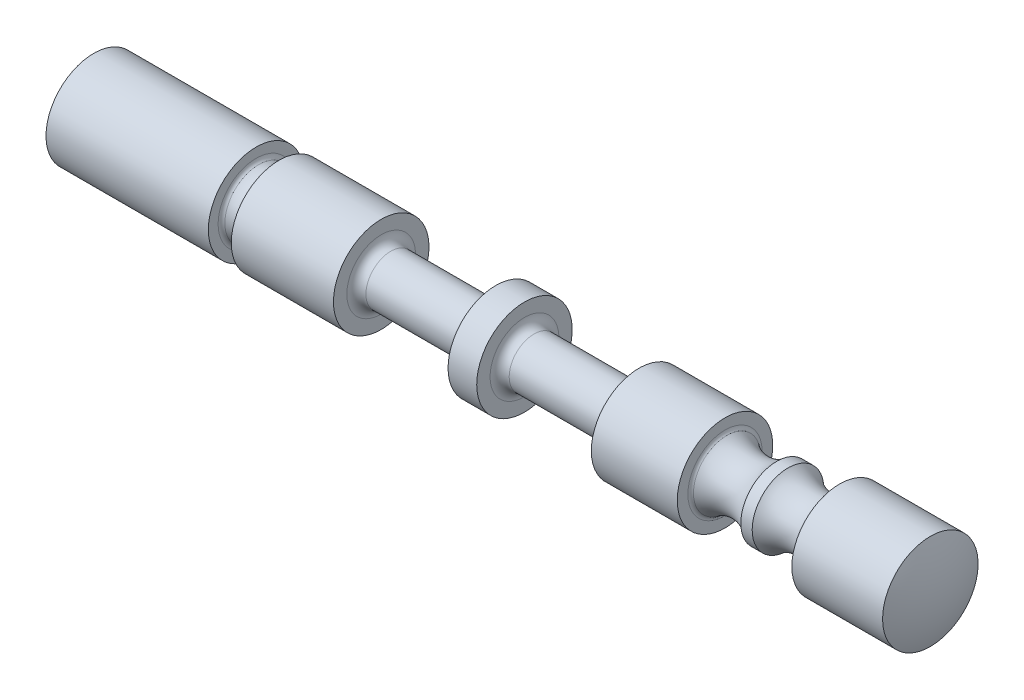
ISO-10303-21;
HEADER;
FILE_DESCRIPTION(('STEP AP214'),'2;1');
FILE_NAME('part.step','',(''),(''),'','','');
FILE_SCHEMA(('AUTOMOTIVE_DESIGN { 1 0 10303 214 1 1 1 1 }'));
ENDSEC;
DATA;
#1=APPLICATION_CONTEXT('core data for automotive mechanical design processes');
#2=APPLICATION_PROTOCOL_DEFINITION('international standard','automotive_design',2000,#1);
#3=PRODUCT_CONTEXT('',#1,'mechanical');
#4=PRODUCT('Part','Part','',(#3));
#5=PRODUCT_RELATED_PRODUCT_CATEGORY('part','',(#4));
#6=PRODUCT_DEFINITION_FORMATION('','',#4);
#7=PRODUCT_DEFINITION_CONTEXT('part definition',#1,'design');
#8=PRODUCT_DEFINITION('design','',#6,#7);
#9=PRODUCT_DEFINITION_SHAPE('','',#8);
#10=(LENGTH_UNIT() NAMED_UNIT(*) SI_UNIT(.MILLI.,.METRE.));
#11=(NAMED_UNIT(*) PLANE_ANGLE_UNIT() SI_UNIT($,.RADIAN.));
#12=(NAMED_UNIT(*) SI_UNIT($,.STERADIAN.) SOLID_ANGLE_UNIT());
#13=UNCERTAINTY_MEASURE_WITH_UNIT(LENGTH_MEASURE(1.E-05),#10,'distance_accuracy_value','');
#14=(GEOMETRIC_REPRESENTATION_CONTEXT(3) GLOBAL_UNCERTAINTY_ASSIGNED_CONTEXT((#13)) GLOBAL_UNIT_ASSIGNED_CONTEXT((#10,
#11,#12)) REPRESENTATION_CONTEXT('',''));
#15=CARTESIAN_POINT('',(0.,0.,0.));
#16=DIRECTION('',(0.,0.,1.));
#17=DIRECTION('',(1.,0.,0.));
#18=AXIS2_PLACEMENT_3D('',#15,#16,#17);
#19=CARTESIAN_POINT('',(-68.,0.,0.));
#20=DIRECTION('',(0.,0.,1.));
#21=DIRECTION('',(1.,0.,0.));
#22=AXIS2_PLACEMENT_3D('',#19,#20,#21);
#23=SPHERICAL_SURFACE('',#22,13.);
#24=CARTESIAN_POINT('',(-68.,0.,0.));
#25=DIRECTION('',(-1.,0.,0.));
#26=DIRECTION('',(0.,0.,1.));
#27=AXIS2_PLACEMENT_3D('',#24,#25,#26);
#28=SPHERICAL_SURFACE('',#27,13.);
#29=CARTESIAN_POINT('',(-80.,0.,0.));
#30=DIRECTION('',(-1.,0.,0.));
#31=DIRECTION('',(0.,0.,1.));
#32=AXIS2_PLACEMENT_3D('',#29,#30,#31);
#33=CIRCLE('',#32,5.);
#34=CARTESIAN_POINT('',(-80.,0.,5.00000000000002));
#35=VERTEX_POINT('',#34);
#36=EDGE_CURVE('E412',#35,#35,#33,.T.);
#37=ORIENTED_EDGE('',*,*,#36,.T.);
#38=EDGE_LOOP('',(#37));
#39=FACE_BOUND('',#38,.T.);
#40=ADVANCED_FACE('F356',(#39),#28,.T.);
#41=CARTESIAN_POINT('',(-110.,0.,0.));
#42=DIRECTION('',(-1.,0.,0.));
#43=DIRECTION('',(0.,0.,1.));
#44=AXIS2_PLACEMENT_3D('',#41,#42,#43);
#45=CYLINDRICAL_SURFACE('',#44,5.);
#46=ORIENTED_EDGE('',*,*,#36,.F.);
#47=EDGE_LOOP('',(#46));
#48=FACE_BOUND('',#47,.T.);
#49=CARTESIAN_POINT('',(-63.,0.,0.));
#50=DIRECTION('',(-1.,0.,0.));
#51=DIRECTION('',(0.,0.,1.));
#52=AXIS2_PLACEMENT_3D('',#49,#50,#51);
#53=CIRCLE('',#52,5.);
#54=CARTESIAN_POINT('',(-63.,0.,5.00000000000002));
#55=VERTEX_POINT('',#54);
#56=EDGE_CURVE('E415',#55,#55,#53,.T.);
#57=ORIENTED_EDGE('',*,*,#56,.T.);
#58=EDGE_LOOP('',(#57));
#59=FACE_BOUND('',#58,.T.);
#60=ADVANCED_FACE('F464',(#48,#59),#45,.T.);
#61=CARTESIAN_POINT('',(-63.,5.0000000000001,0.));
#62=DIRECTION('',(-1.,0.,0.));
#63=DIRECTION('',(0.,0.,1.));
#64=AXIS2_PLACEMENT_3D('',#61,#62,#63);
#65=PLANE('',#64);
#66=CARTESIAN_POINT('',(-63.,0.,0.));
#67=DIRECTION('',(-1.,0.,0.));
#68=DIRECTION('',(0.,0.,1.));
#69=AXIS2_PLACEMENT_3D('',#66,#67,#68);
#70=CIRCLE('',#69,3.97822521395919);
#71=CARTESIAN_POINT('',(-63.,0.,3.97822521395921));
#72=VERTEX_POINT('',#71);
#73=EDGE_CURVE('E409',#72,#72,#70,.T.);
#74=ORIENTED_EDGE('',*,*,#73,.T.);
#75=EDGE_LOOP('',(#74));
#76=FACE_BOUND('',#75,.T.);
#77=ORIENTED_EDGE('',*,*,#56,.F.);
#78=EDGE_LOOP('',(#77));
#79=FACE_BOUND('',#78,.T.);
#80=ADVANCED_FACE('F469',(#76,#79),#65,.F.);
#81=CARTESIAN_POINT('',(-61.8,0.,0.));
#82=DIRECTION('',(-1.,0.,0.));
#83=DIRECTION('',(0.,0.,1.));
#84=AXIS2_PLACEMENT_3D('',#81,#82,#83);
#85=TOROIDAL_SURFACE('',#84,5.30487513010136,2.);
#86=CARTESIAN_POINT('',(-62.7333333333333,0.,0.));
#87=DIRECTION('',(1.,0.,0.));
#88=DIRECTION('',(0.,0.,-1.));
#89=AXIS2_PLACEMENT_3D('',#86,#87,#88);
#90=CIRCLE('',#89,3.53600857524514);
#91=CARTESIAN_POINT('',(-62.7333333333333,0.,-3.53600857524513));
#92=VERTEX_POINT('',#91);
#93=EDGE_CURVE('E403',#92,#92,#90,.T.);
#94=ORIENTED_EDGE('',*,*,#93,.T.);
#95=EDGE_LOOP('',(#94));
#96=FACE_BOUND('',#95,.T.);
#97=CARTESIAN_POINT('',(-60.8666666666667,0.,0.));
#98=DIRECTION('',(-1.,0.,0.));
#99=DIRECTION('',(0.,0.,1.));
#100=AXIS2_PLACEMENT_3D('',#97,#98,#99);
#101=CIRCLE('',#100,3.53600857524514);
#102=CARTESIAN_POINT('',(-60.8666666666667,0.,3.53600857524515));
#103=VERTEX_POINT('',#102);
#104=EDGE_CURVE('E406',#103,#103,#101,.T.);
#105=ORIENTED_EDGE('',*,*,#104,.T.);
#106=EDGE_LOOP('',(#105));
#107=FACE_BOUND('',#106,.T.);
#108=ADVANCED_FACE('F475',(#96,#107),#85,.F.);
#109=CARTESIAN_POINT('',(-60.6,5.0000000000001,0.));
#110=DIRECTION('',(1.,0.,0.));
#111=DIRECTION('',(0.,0.,-1.));
#112=AXIS2_PLACEMENT_3D('',#109,#110,#111);
#113=PLANE('',#112);
#114=CARTESIAN_POINT('',(-60.6,0.,0.));
#115=DIRECTION('',(1.,0.,0.));
#116=DIRECTION('',(0.,0.,-1.));
#117=AXIS2_PLACEMENT_3D('',#114,#115,#116);
#118=CIRCLE('',#117,3.97822521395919);
#119=CARTESIAN_POINT('',(-60.6,0.,-3.97822521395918));
#120=VERTEX_POINT('',#119);
#121=EDGE_CURVE('E388',#120,#120,#118,.T.);
#122=ORIENTED_EDGE('',*,*,#121,.T.);
#123=EDGE_LOOP('',(#122));
#124=FACE_BOUND('',#123,.T.);
#125=CARTESIAN_POINT('',(-60.6,0.,0.));
#126=DIRECTION('',(-1.,0.,0.));
#127=DIRECTION('',(0.,0.,1.));
#128=AXIS2_PLACEMENT_3D('',#125,#126,#127);
#129=CIRCLE('',#128,5.);
#130=CARTESIAN_POINT('',(-60.6,0.,5.00000000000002));
#131=VERTEX_POINT('',#130);
#132=EDGE_CURVE('E418',#131,#131,#129,.T.);
#133=ORIENTED_EDGE('',*,*,#132,.T.);
#134=EDGE_LOOP('',(#133));
#135=FACE_BOUND('',#134,.T.);
#136=ADVANCED_FACE('F479',(#124,#135),#113,.F.);
#137=CARTESIAN_POINT('',(-110.,0.,0.));
#138=DIRECTION('',(-1.,0.,0.));
#139=DIRECTION('',(0.,0.,1.));
#140=AXIS2_PLACEMENT_3D('',#137,#138,#139);
#141=CYLINDRICAL_SURFACE('',#140,5.);
#142=ORIENTED_EDGE('',*,*,#132,.F.);
#143=EDGE_LOOP('',(#142));
#144=FACE_BOUND('',#143,.T.);
#145=CARTESIAN_POINT('',(-49.9,1.11022302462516E-13,0.));
#146=DIRECTION('',(-1.,0.,0.));
#147=DIRECTION('',(0.,0.,1.));
#148=AXIS2_PLACEMENT_3D('',#145,#146,#147);
#149=CIRCLE('',#148,5.);
#150=CARTESIAN_POINT('',(-49.9,1.11022302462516E-13,5.00000000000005));
#151=VERTEX_POINT('',#150);
#152=EDGE_CURVE('E421',#151,#151,#149,.T.);
#153=ORIENTED_EDGE('',*,*,#152,.T.);
#154=EDGE_LOOP('',(#153));
#155=FACE_BOUND('',#154,.T.);
#156=ADVANCED_FACE('F483',(#144,#155),#141,.T.);
#157=CARTESIAN_POINT('',(-49.9,5.00000000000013,0.));
#158=DIRECTION('',(-1.,0.,0.));
#159=DIRECTION('',(0.,0.,1.));
#160=AXIS2_PLACEMENT_3D('',#157,#158,#159);
#161=PLANE('',#160);
#162=CARTESIAN_POINT('',(-49.9,1.11022302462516E-13,0.));
#163=DIRECTION('',(-1.,0.,0.));
#164=DIRECTION('',(0.,0.,1.));
#165=AXIS2_PLACEMENT_3D('',#162,#163,#164);
#166=CIRCLE('',#165,3.6);
#167=CARTESIAN_POINT('',(-49.9,1.11022302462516E-13,3.60000000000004));
#168=VERTEX_POINT('',#167);
#169=EDGE_CURVE('E385',#168,#168,#166,.T.);
#170=ORIENTED_EDGE('',*,*,#169,.T.);
#171=EDGE_LOOP('',(#170));
#172=FACE_BOUND('',#171,.T.);
#173=ORIENTED_EDGE('',*,*,#152,.F.);
#174=EDGE_LOOP('',(#173));
#175=FACE_BOUND('',#174,.T.);
#176=ADVANCED_FACE('F487',(#172,#175),#161,.F.);
#177=CARTESIAN_POINT('',(-110.,0.,0.));
#178=DIRECTION('',(-1.,0.,0.));
#179=DIRECTION('',(0.,0.,1.));
#180=AXIS2_PLACEMENT_3D('',#177,#178,#179);
#181=CYLINDRICAL_SURFACE('',#180,2.6);
#182=CARTESIAN_POINT('',(-48.9,1.17961196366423E-13,0.));
#183=DIRECTION('',(-1.,0.,0.));
#184=DIRECTION('',(0.,0.,1.));
#185=AXIS2_PLACEMENT_3D('',#182,#183,#184);
#186=CIRCLE('',#185,2.6);
#187=CARTESIAN_POINT('',(-48.9,1.17961196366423E-13,2.60000000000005));
#188=VERTEX_POINT('',#187);
#189=EDGE_CURVE('E379',#188,#188,#186,.F.);
#190=ORIENTED_EDGE('',*,*,#189,.T.);
#191=EDGE_LOOP('',(#190));
#192=FACE_BOUND('',#191,.T.);
#193=CARTESIAN_POINT('',(-38.9,1.31838984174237E-13,0.));
#194=DIRECTION('',(1.,0.,0.));
#195=DIRECTION('',(0.,0.,-1.));
#196=AXIS2_PLACEMENT_3D('',#193,#194,#195);
#197=CIRCLE('',#196,2.6);
#198=CARTESIAN_POINT('',(-38.9,1.31838984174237E-13,-2.59999999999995));
#199=VERTEX_POINT('',#198);
#200=EDGE_CURVE('E382',#199,#199,#197,.F.);
#201=ORIENTED_EDGE('',*,*,#200,.T.);
#202=EDGE_LOOP('',(#201));
#203=FACE_BOUND('',#202,.T.);
#204=ADVANCED_FACE('F491',(#192,#203),#181,.T.);
#205=CARTESIAN_POINT('',(-37.9,2.60000000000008,0.));
#206=DIRECTION('',(1.,0.,0.));
#207=DIRECTION('',(0.,0.,-1.));
#208=AXIS2_PLACEMENT_3D('',#205,#206,#207);
#209=PLANE('',#208);
#210=CARTESIAN_POINT('',(-37.9,1.31838984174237E-13,0.));
#211=DIRECTION('',(1.,0.,0.));
#212=DIRECTION('',(0.,0.,-1.));
#213=AXIS2_PLACEMENT_3D('',#210,#211,#212);
#214=CIRCLE('',#213,3.6);
#215=CARTESIAN_POINT('',(-37.9,1.31838984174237E-13,-3.59999999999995));
#216=VERTEX_POINT('',#215);
#217=EDGE_CURVE('E363',#216,#216,#214,.T.);
#218=ORIENTED_EDGE('',*,*,#217,.T.);
#219=EDGE_LOOP('',(#218));
#220=FACE_BOUND('',#219,.T.);
#221=CARTESIAN_POINT('',(-37.9,1.31838984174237E-13,0.));
#222=DIRECTION('',(-1.,0.,0.));
#223=DIRECTION('',(0.,0.,1.));
#224=AXIS2_PLACEMENT_3D('',#221,#222,#223);
#225=CIRCLE('',#224,5.);
#226=CARTESIAN_POINT('',(-37.9,1.31838984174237E-13,5.00000000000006));
#227=VERTEX_POINT('',#226);
#228=EDGE_CURVE('E424',#227,#227,#225,.T.);
#229=ORIENTED_EDGE('',*,*,#228,.T.);
#230=EDGE_LOOP('',(#229));
#231=FACE_BOUND('',#230,.T.);
#232=ADVANCED_FACE('F495',(#220,#231),#209,.F.);
#233=CARTESIAN_POINT('',(-110.,0.,0.));
#234=DIRECTION('',(-1.,0.,0.));
#235=DIRECTION('',(0.,0.,1.));
#236=AXIS2_PLACEMENT_3D('',#233,#234,#235);
#237=CYLINDRICAL_SURFACE('',#236,5.);
#238=ORIENTED_EDGE('',*,*,#228,.F.);
#239=EDGE_LOOP('',(#238));
#240=FACE_BOUND('',#239,.T.);
#241=CARTESIAN_POINT('',(-34.9,1.31838984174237E-13,0.));
#242=DIRECTION('',(-1.,0.,0.));
#243=DIRECTION('',(0.,0.,1.));
#244=AXIS2_PLACEMENT_3D('',#241,#242,#243);
#245=CIRCLE('',#244,5.);
#246=CARTESIAN_POINT('',(-34.9,1.31838984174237E-13,5.00000000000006));
#247=VERTEX_POINT('',#246);
#248=EDGE_CURVE('E427',#247,#247,#245,.T.);
#249=ORIENTED_EDGE('',*,*,#248,.T.);
#250=EDGE_LOOP('',(#249));
#251=FACE_BOUND('',#250,.T.);
#252=ADVANCED_FACE('F499',(#240,#251),#237,.T.);
#253=CARTESIAN_POINT('',(-34.9,5.00000000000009,0.));
#254=DIRECTION('',(-1.,0.,0.));
#255=DIRECTION('',(0.,0.,1.));
#256=AXIS2_PLACEMENT_3D('',#253,#254,#255);
#257=PLANE('',#256);
#258=CARTESIAN_POINT('',(-34.9,1.31838984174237E-13,0.));
#259=DIRECTION('',(-1.,0.,0.));
#260=DIRECTION('',(0.,0.,1.));
#261=AXIS2_PLACEMENT_3D('',#258,#259,#260);
#262=CIRCLE('',#261,3.60000000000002);
#263=CARTESIAN_POINT('',(-34.9,1.31838984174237E-13,3.60000000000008));
#264=VERTEX_POINT('',#263);
#265=EDGE_CURVE('E376',#264,#264,#262,.T.);
#266=ORIENTED_EDGE('',*,*,#265,.T.);
#267=EDGE_LOOP('',(#266));
#268=FACE_BOUND('',#267,.T.);
#269=ORIENTED_EDGE('',*,*,#248,.F.);
#270=EDGE_LOOP('',(#269));
#271=FACE_BOUND('',#270,.T.);
#272=ADVANCED_FACE('F502',(#268,#271),#257,.F.);
#273=CARTESIAN_POINT('',(-110.,0.,0.));
#274=DIRECTION('',(-1.,0.,0.));
#275=DIRECTION('',(0.,0.,1.));
#276=AXIS2_PLACEMENT_3D('',#273,#274,#275);
#277=CYLINDRICAL_SURFACE('',#276,2.60000000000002);
#278=CARTESIAN_POINT('',(-33.9,1.31838984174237E-13,0.));
#279=DIRECTION('',(-1.,0.,0.));
#280=DIRECTION('',(0.,0.,1.));
#281=AXIS2_PLACEMENT_3D('',#278,#279,#280);
#282=CIRCLE('',#281,2.60000000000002);
#283=CARTESIAN_POINT('',(-33.9,1.31838984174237E-13,2.60000000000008));
#284=VERTEX_POINT('',#283);
#285=EDGE_CURVE('E367',#284,#284,#282,.F.);
#286=ORIENTED_EDGE('',*,*,#285,.T.);
#287=EDGE_LOOP('',(#286));
#288=FACE_BOUND('',#287,.T.);
#289=CARTESIAN_POINT('',(-23.9,1.31838984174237E-13,0.));
#290=DIRECTION('',(1.,0.,0.));
#291=DIRECTION('',(0.,0.,-1.));
#292=AXIS2_PLACEMENT_3D('',#289,#290,#291);
#293=CIRCLE('',#292,2.60000000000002);
#294=CARTESIAN_POINT('',(-23.9,1.31838984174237E-13,-2.59999999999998));
#295=VERTEX_POINT('',#294);
#296=EDGE_CURVE('E371',#295,#295,#293,.F.);
#297=ORIENTED_EDGE('',*,*,#296,.T.);
#298=EDGE_LOOP('',(#297));
#299=FACE_BOUND('',#298,.T.);
#300=ADVANCED_FACE('F506',(#288,#299),#277,.T.);
#301=CARTESIAN_POINT('',(-22.9,2.60000000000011,0.));
#302=DIRECTION('',(1.,0.,0.));
#303=DIRECTION('',(0.,0.,-1.));
#304=AXIS2_PLACEMENT_3D('',#301,#302,#303);
#305=PLANE('',#304);
#306=CARTESIAN_POINT('',(-22.9,1.45716771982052E-13,0.));
#307=DIRECTION('',(1.,0.,0.));
#308=DIRECTION('',(0.,0.,-1.));
#309=AXIS2_PLACEMENT_3D('',#306,#307,#308);
#310=CIRCLE('',#309,3.60000000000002);
#311=CARTESIAN_POINT('',(-22.9,1.45716771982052E-13,-3.59999999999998));
#312=VERTEX_POINT('',#311);
#313=EDGE_CURVE('E12',#312,#312,#310,.T.);
#314=ORIENTED_EDGE('',*,*,#313,.T.);
#315=EDGE_LOOP('',(#314));
#316=FACE_BOUND('',#315,.T.);
#317=CARTESIAN_POINT('',(-22.9,1.45716771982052E-13,0.));
#318=DIRECTION('',(-1.,0.,0.));
#319=DIRECTION('',(0.,0.,1.));
#320=AXIS2_PLACEMENT_3D('',#317,#318,#319);
#321=CIRCLE('',#320,4.99999999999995);
#322=CARTESIAN_POINT('',(-22.9,1.45716771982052E-13,4.99999999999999));
#323=VERTEX_POINT('',#322);
#324=EDGE_CURVE('E430',#323,#323,#321,.T.);
#325=ORIENTED_EDGE('',*,*,#324,.T.);
#326=EDGE_LOOP('',(#325));
#327=FACE_BOUND('',#326,.T.);
#328=ADVANCED_FACE('F510',(#316,#327),#305,.F.);
#329=CARTESIAN_POINT('',(-110.,0.,0.));
#330=DIRECTION('',(-1.,0.,0.));
#331=DIRECTION('',(0.,0.,1.));
#332=AXIS2_PLACEMENT_3D('',#329,#330,#331);
#333=CYLINDRICAL_SURFACE('',#332,4.99999999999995);
#334=ORIENTED_EDGE('',*,*,#324,.F.);
#335=EDGE_LOOP('',(#334));
#336=FACE_BOUND('',#335,.T.);
#337=CARTESIAN_POINT('',(-13.9,0.,0.));
#338=DIRECTION('',(-1.,0.,0.));
#339=DIRECTION('',(0.,0.,1.));
#340=AXIS2_PLACEMENT_3D('',#337,#338,#339);
#341=CIRCLE('',#340,4.99999999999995);
#342=CARTESIAN_POINT('',(-13.9,0.,4.99999999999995));
#343=VERTEX_POINT('',#342);
#344=EDGE_CURVE('E433',#343,#343,#341,.T.);
#345=ORIENTED_EDGE('',*,*,#344,.T.);
#346=EDGE_LOOP('',(#345));
#347=FACE_BOUND('',#346,.T.);
#348=ADVANCED_FACE('F514',(#336,#347),#333,.T.);
#349=CARTESIAN_POINT('',(-13.9,5.00000000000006,0.));
#350=DIRECTION('',(-1.,0.,0.));
#351=DIRECTION('',(0.,0.,1.));
#352=AXIS2_PLACEMENT_3D('',#349,#350,#351);
#353=PLANE('',#352);
#354=CARTESIAN_POINT('',(-13.9,0.,0.));
#355=DIRECTION('',(-1.,0.,0.));
#356=DIRECTION('',(0.,0.,1.));
#357=AXIS2_PLACEMENT_3D('',#354,#355,#356);
#358=CIRCLE('',#357,3.88820710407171);
#359=CARTESIAN_POINT('',(-13.9,0.,3.88820710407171));
#360=VERTEX_POINT('',#359);
#361=EDGE_CURVE('E400',#360,#360,#358,.T.);
#362=ORIENTED_EDGE('',*,*,#361,.T.);
#363=EDGE_LOOP('',(#362));
#364=FACE_BOUND('',#363,.T.);
#365=ORIENTED_EDGE('',*,*,#344,.F.);
#366=EDGE_LOOP('',(#365));
#367=FACE_BOUND('',#366,.T.);
#368=ADVANCED_FACE('F517',(#364,#367),#353,.F.);
#369=CARTESIAN_POINT('',(-11.25,0.,0.));
#370=DIRECTION('',(-1.,0.,0.));
#371=DIRECTION('',(0.,0.,1.));
#372=AXIS2_PLACEMENT_3D('',#369,#370,#371);
#373=TOROIDAL_SURFACE('',#372,6.65,4.);
#374=CARTESIAN_POINT('',(-13.7071428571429,0.,0.));
#375=DIRECTION('',(1.,0.,0.));
#376=DIRECTION('',(0.,0.,-1.));
#377=AXIS2_PLACEMENT_3D('',#374,#375,#376);
#378=CIRCLE('',#377,3.49366526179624);
#379=CARTESIAN_POINT('',(-13.7071428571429,0.,-3.49366526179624));
#380=VERTEX_POINT('',#379);
#381=EDGE_CURVE('E397',#380,#380,#378,.T.);
#382=ORIENTED_EDGE('',*,*,#381,.T.);
#383=EDGE_LOOP('',(#382));
#384=FACE_BOUND('',#383,.T.);
#385=CARTESIAN_POINT('',(-8.49500453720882,0.,0.));
#386=DIRECTION('',(-1.,0.,0.));
#387=DIRECTION('',(0.,0.,1.));
#388=AXIS2_PLACEMENT_3D('',#385,#386,#387);
#389=CIRCLE('',#388,3.75);
#390=CARTESIAN_POINT('',(-8.49500453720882,0.,3.75));
#391=VERTEX_POINT('',#390);
#392=EDGE_CURVE('E436',#391,#391,#389,.T.);
#393=ORIENTED_EDGE('',*,*,#392,.T.);
#394=EDGE_LOOP('',(#393));
#395=FACE_BOUND('',#394,.T.);
#396=ADVANCED_FACE('F521',(#384,#395),#373,.F.);
#397=CARTESIAN_POINT('',(-110.,0.,0.));
#398=DIRECTION('',(-1.,0.,0.));
#399=DIRECTION('',(0.,0.,1.));
#400=AXIS2_PLACEMENT_3D('',#397,#398,#399);
#401=CYLINDRICAL_SURFACE('',#400,3.75);
#402=ORIENTED_EDGE('',*,*,#392,.F.);
#403=EDGE_LOOP('',(#402));
#404=FACE_BOUND('',#403,.T.);
#405=CARTESIAN_POINT('',(-7.30499546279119,0.,0.));
#406=DIRECTION('',(-1.,0.,0.));
#407=DIRECTION('',(0.,0.,1.));
#408=AXIS2_PLACEMENT_3D('',#405,#406,#407);
#409=CIRCLE('',#408,3.75);
#410=CARTESIAN_POINT('',(-7.30499546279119,0.,3.75));
#411=VERTEX_POINT('',#410);
#412=EDGE_CURVE('E439',#411,#411,#409,.T.);
#413=ORIENTED_EDGE('',*,*,#412,.T.);
#414=EDGE_LOOP('',(#413));
#415=FACE_BOUND('',#414,.T.);
#416=ADVANCED_FACE('F525',(#404,#415),#401,.T.);
#417=CARTESIAN_POINT('',(-4.55000000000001,0.,0.));
#418=DIRECTION('',(-1.,0.,0.));
#419=DIRECTION('',(0.,0.,1.));
#420=AXIS2_PLACEMENT_3D('',#417,#418,#419);
#421=TOROIDAL_SURFACE('',#420,6.65,4.);
#422=CARTESIAN_POINT('',(-2.09285714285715,0.,0.));
#423=DIRECTION('',(-1.,0.,0.));
#424=DIRECTION('',(0.,0.,1.));
#425=AXIS2_PLACEMENT_3D('',#422,#423,#424);
#426=CIRCLE('',#425,3.49366526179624);
#427=CARTESIAN_POINT('',(-2.09285714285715,0.,3.49366526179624));
#428=VERTEX_POINT('',#427);
#429=EDGE_CURVE('E394',#428,#428,#426,.T.);
#430=ORIENTED_EDGE('',*,*,#429,.T.);
#431=EDGE_LOOP('',(#430));
#432=FACE_BOUND('',#431,.T.);
#433=ORIENTED_EDGE('',*,*,#412,.F.);
#434=EDGE_LOOP('',(#433));
#435=FACE_BOUND('',#434,.T.);
#436=ADVANCED_FACE('F529',(#432,#435),#421,.F.);
#437=CARTESIAN_POINT('',(-1.90000000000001,5.00000000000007,0.));
#438=DIRECTION('',(1.,0.,0.));
#439=DIRECTION('',(0.,0.,-1.));
#440=AXIS2_PLACEMENT_3D('',#437,#438,#439);
#441=PLANE('',#440);
#442=CARTESIAN_POINT('',(-1.90000000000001,0.,0.));
#443=DIRECTION('',(1.,0.,0.));
#444=DIRECTION('',(0.,0.,-1.));
#445=AXIS2_PLACEMENT_3D('',#442,#443,#444);
#446=CIRCLE('',#445,3.88820710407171);
#447=CARTESIAN_POINT('',(-1.90000000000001,0.,-3.88820710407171));
#448=VERTEX_POINT('',#447);
#449=EDGE_CURVE('E391',#448,#448,#446,.T.);
#450=ORIENTED_EDGE('',*,*,#449,.T.);
#451=EDGE_LOOP('',(#450));
#452=FACE_BOUND('',#451,.T.);
#453=CARTESIAN_POINT('',(-1.90000000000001,0.,0.));
#454=DIRECTION('',(-1.,0.,0.));
#455=DIRECTION('',(0.,0.,1.));
#456=AXIS2_PLACEMENT_3D('',#453,#454,#455);
#457=CIRCLE('',#456,4.99999999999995);
#458=CARTESIAN_POINT('',(-1.90000000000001,0.,4.99999999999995));
#459=VERTEX_POINT('',#458);
#460=EDGE_CURVE('E442',#459,#459,#457,.T.);
#461=ORIENTED_EDGE('',*,*,#460,.T.);
#462=EDGE_LOOP('',(#461));
#463=FACE_BOUND('',#462,.T.);
#464=ADVANCED_FACE('F461',(#452,#463),#441,.F.);
#465=CARTESIAN_POINT('',(-110.,0.,0.));
#466=DIRECTION('',(-1.,0.,0.));
#467=DIRECTION('',(0.,0.,1.));
#468=AXIS2_PLACEMENT_3D('',#465,#466,#467);
#469=CYLINDRICAL_SURFACE('',#468,4.99999999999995);
#470=ORIENTED_EDGE('',*,*,#460,.F.);
#471=EDGE_LOOP('',(#470));
#472=FACE_BOUND('',#471,.T.);
#473=CARTESIAN_POINT('',(7.6,0.,0.));
#474=DIRECTION('',(-1.,0.,0.));
#475=DIRECTION('',(0.,0.,1.));
#476=AXIS2_PLACEMENT_3D('',#473,#474,#475);
#477=CIRCLE('',#476,4.99999999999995);
#478=CARTESIAN_POINT('',(7.6,0.,4.99999999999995));
#479=VERTEX_POINT('',#478);
#480=EDGE_CURVE('E445',#479,#479,#477,.T.);
#481=ORIENTED_EDGE('',*,*,#480,.T.);
#482=EDGE_LOOP('',(#481));
#483=FACE_BOUND('',#482,.T.);
#484=ADVANCED_FACE('F449',(#472,#483),#469,.T.);
#485=CARTESIAN_POINT('',(-4.39999999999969,0.,0.));
#486=DIRECTION('',(0.,0.,1.));
#487=DIRECTION('',(1.,0.,0.));
#488=AXIS2_PLACEMENT_3D('',#485,#486,#487);
#489=SPHERICAL_SURFACE('',#488,12.9999999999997);
#490=CARTESIAN_POINT('',(-4.39999999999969,0.,0.));
#491=DIRECTION('',(-1.,0.,0.));
#492=DIRECTION('',(0.,0.,1.));
#493=AXIS2_PLACEMENT_3D('',#490,#491,#492);
#494=SPHERICAL_SURFACE('',#493,12.9999999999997);
#495=ORIENTED_EDGE('',*,*,#480,.F.);
#496=EDGE_LOOP('',(#495));
#497=FACE_BOUND('',#496,.T.);
#498=ADVANCED_FACE('F358',(#497),#494,.T.);
#499=CARTESIAN_POINT('',(-62.5,0.,0.));
#500=DIRECTION('',(1.,0.,0.));
#501=DIRECTION('',(0.,0.,-1.));
#502=AXIS2_PLACEMENT_3D('',#499,#500,#501);
#503=TOROIDAL_SURFACE('',#502,3.97822521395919,0.5);
#504=ORIENTED_EDGE('',*,*,#93,.F.);
#505=EDGE_LOOP('',(#504));
#506=FACE_BOUND('',#505,.T.);
#507=ORIENTED_EDGE('',*,*,#73,.F.);
#508=EDGE_LOOP('',(#507));
#509=FACE_BOUND('',#508,.T.);
#510=ADVANCED_FACE('F452',(#506,#509),#503,.F.);
#511=CARTESIAN_POINT('',(-13.4,0.,0.));
#512=DIRECTION('',(1.,0.,0.));
#513=DIRECTION('',(0.,0.,-1.));
#514=AXIS2_PLACEMENT_3D('',#511,#512,#513);
#515=TOROIDAL_SURFACE('',#514,3.88820710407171,0.5);
#516=ORIENTED_EDGE('',*,*,#381,.F.);
#517=EDGE_LOOP('',(#516));
#518=FACE_BOUND('',#517,.T.);
#519=ORIENTED_EDGE('',*,*,#361,.F.);
#520=EDGE_LOOP('',(#519));
#521=FACE_BOUND('',#520,.T.);
#522=ADVANCED_FACE('F457',(#518,#521),#515,.F.);
#523=CARTESIAN_POINT('',(-2.40000000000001,0.,0.));
#524=DIRECTION('',(-1.,0.,0.));
#525=DIRECTION('',(0.,0.,1.));
#526=AXIS2_PLACEMENT_3D('',#523,#524,#525);
#527=TOROIDAL_SURFACE('',#526,3.88820710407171,0.5);
#528=ORIENTED_EDGE('',*,*,#449,.F.);
#529=EDGE_LOOP('',(#528));
#530=FACE_BOUND('',#529,.T.);
#531=ORIENTED_EDGE('',*,*,#429,.F.);
#532=EDGE_LOOP('',(#531));
#533=FACE_BOUND('',#532,.T.);
#534=ADVANCED_FACE('F539',(#530,#533),#527,.F.);
#535=CARTESIAN_POINT('',(-61.1,0.,0.));
#536=DIRECTION('',(-1.,0.,0.));
#537=DIRECTION('',(0.,0.,1.));
#538=AXIS2_PLACEMENT_3D('',#535,#536,#537);
#539=TOROIDAL_SURFACE('',#538,3.97822521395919,0.5);
#540=ORIENTED_EDGE('',*,*,#121,.F.);
#541=EDGE_LOOP('',(#540));
#542=FACE_BOUND('',#541,.T.);
#543=ORIENTED_EDGE('',*,*,#104,.F.);
#544=EDGE_LOOP('',(#543));
#545=FACE_BOUND('',#544,.T.);
#546=ADVANCED_FACE('F543',(#542,#545),#539,.F.);
#547=CARTESIAN_POINT('',(-48.9,1.17961196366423E-13,0.));
#548=DIRECTION('',(-1.,0.,0.));
#549=DIRECTION('',(0.,0.,1.));
#550=AXIS2_PLACEMENT_3D('',#547,#548,#549);
#551=TOROIDAL_SURFACE('',#550,3.6,1.);
#552=ORIENTED_EDGE('',*,*,#189,.F.);
#553=EDGE_LOOP('',(#552));
#554=FACE_BOUND('',#553,.T.);
#555=ORIENTED_EDGE('',*,*,#169,.F.);
#556=EDGE_LOOP('',(#555));
#557=FACE_BOUND('',#556,.T.);
#558=ADVANCED_FACE('F547',(#554,#557),#551,.F.);
#559=CARTESIAN_POINT('',(-33.9,1.31838984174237E-13,0.));
#560=DIRECTION('',(-1.,0.,0.));
#561=DIRECTION('',(0.,0.,1.));
#562=AXIS2_PLACEMENT_3D('',#559,#560,#561);
#563=TOROIDAL_SURFACE('',#562,3.60000000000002,1.);
#564=ORIENTED_EDGE('',*,*,#285,.F.);
#565=EDGE_LOOP('',(#564));
#566=FACE_BOUND('',#565,.T.);
#567=ORIENTED_EDGE('',*,*,#265,.F.);
#568=EDGE_LOOP('',(#567));
#569=FACE_BOUND('',#568,.T.);
#570=ADVANCED_FACE('F551',(#566,#569),#563,.F.);
#571=CARTESIAN_POINT('',(-38.9,1.31838984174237E-13,0.));
#572=DIRECTION('',(1.,0.,0.));
#573=DIRECTION('',(0.,0.,-1.));
#574=AXIS2_PLACEMENT_3D('',#571,#572,#573);
#575=TOROIDAL_SURFACE('',#574,3.6,1.);
#576=ORIENTED_EDGE('',*,*,#217,.F.);
#577=EDGE_LOOP('',(#576));
#578=FACE_BOUND('',#577,.T.);
#579=ORIENTED_EDGE('',*,*,#200,.F.);
#580=EDGE_LOOP('',(#579));
#581=FACE_BOUND('',#580,.T.);
#582=ADVANCED_FACE('F555',(#578,#581),#575,.F.);
#583=CARTESIAN_POINT('',(-23.9,1.31838984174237E-13,0.));
#584=DIRECTION('',(1.,0.,0.));
#585=DIRECTION('',(0.,0.,-1.));
#586=AXIS2_PLACEMENT_3D('',#583,#584,#585);
#587=TOROIDAL_SURFACE('',#586,3.60000000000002,1.);
#588=ORIENTED_EDGE('',*,*,#313,.F.);
#589=EDGE_LOOP('',(#588));
#590=FACE_BOUND('',#589,.T.);
#591=ORIENTED_EDGE('',*,*,#296,.F.);
#592=EDGE_LOOP('',(#591));
#593=FACE_BOUND('',#592,.T.);
#594=ADVANCED_FACE('F559',(#590,#593),#587,.F.);
#595=CLOSED_SHELL('',(#40,#60,#80,#108,#136,#156,#176,#204,#232,#252,#272,#300,#328,#348,#368,
#396,#416,#436,#464,#484,#498,#510,#522,#534,#546,#558,#570,#582,#594));
#596=MANIFOLD_SOLID_BREP('B2',#595);
#597=ADVANCED_BREP_SHAPE_REPRESENTATION('',(#18,#596),#14);
#598=SHAPE_DEFINITION_REPRESENTATION(#9,#597);
ENDSEC;
END-ISO-10303-21;
